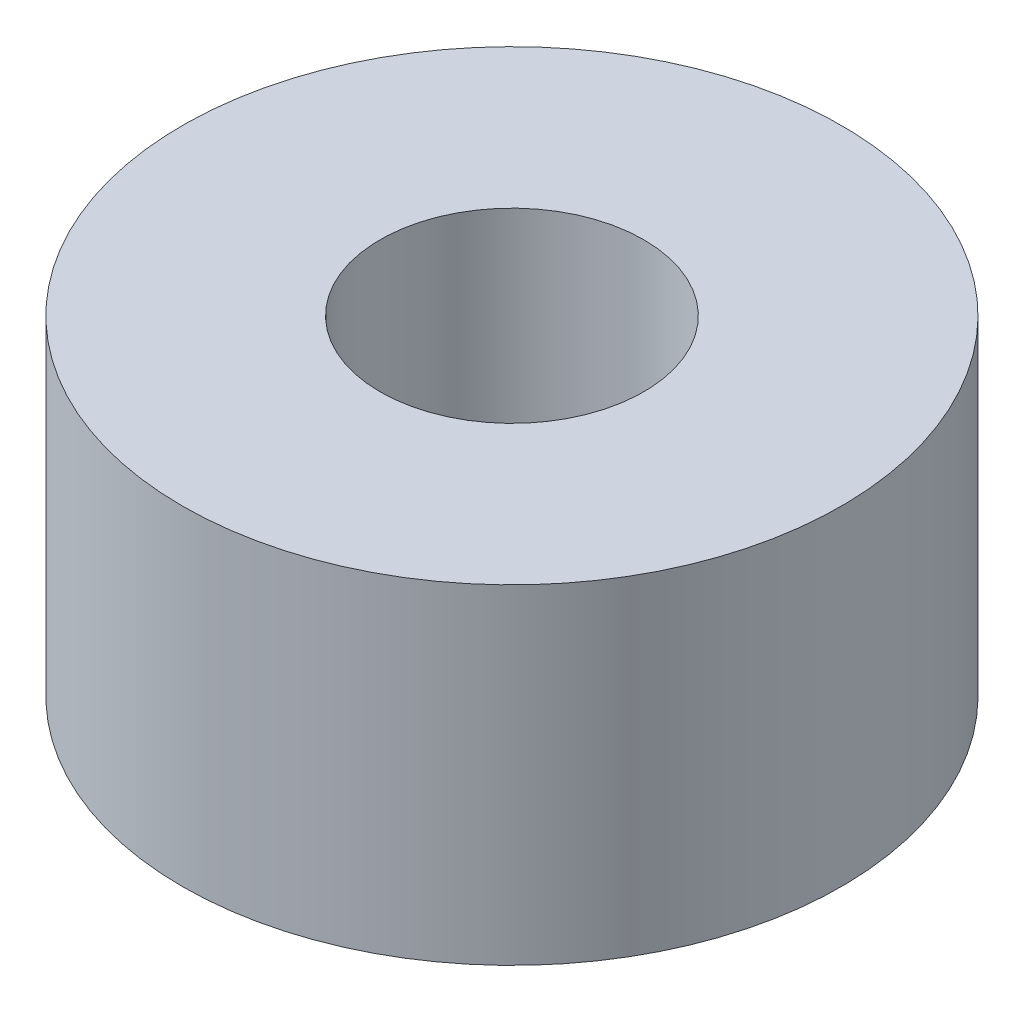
ISO-10303-21;
HEADER;
FILE_DESCRIPTION(('STEP AP214'),'2;1');
FILE_NAME('part.step','',(''),(''),'','','');
FILE_SCHEMA(('AUTOMOTIVE_DESIGN { 1 0 10303 214 1 1 1 1 }'));
ENDSEC;
DATA;
#1=APPLICATION_CONTEXT('core data for automotive mechanical design processes');
#2=APPLICATION_PROTOCOL_DEFINITION('international standard','automotive_design',2000,#1);
#3=PRODUCT_CONTEXT('',#1,'mechanical');
#4=PRODUCT('Part','Part','',(#3));
#5=PRODUCT_RELATED_PRODUCT_CATEGORY('part','',(#4));
#6=PRODUCT_DEFINITION_FORMATION('','',#4);
#7=PRODUCT_DEFINITION_CONTEXT('part definition',#1,'design');
#8=PRODUCT_DEFINITION('design','',#6,#7);
#9=PRODUCT_DEFINITION_SHAPE('','',#8);
#10=(LENGTH_UNIT() NAMED_UNIT(*) SI_UNIT(.MILLI.,.METRE.));
#11=(NAMED_UNIT(*) PLANE_ANGLE_UNIT() SI_UNIT($,.RADIAN.));
#12=(NAMED_UNIT(*) SI_UNIT($,.STERADIAN.) SOLID_ANGLE_UNIT());
#13=UNCERTAINTY_MEASURE_WITH_UNIT(LENGTH_MEASURE(1.E-05),#10,'distance_accuracy_value','');
#14=(GEOMETRIC_REPRESENTATION_CONTEXT(3) GLOBAL_UNCERTAINTY_ASSIGNED_CONTEXT((#13)) GLOBAL_UNIT_ASSIGNED_CONTEXT((#10,
#11,#12)) REPRESENTATION_CONTEXT('',''));
#15=CARTESIAN_POINT('',(0.,0.,0.));
#16=DIRECTION('',(0.,0.,1.));
#17=DIRECTION('',(1.,0.,0.));
#18=AXIS2_PLACEMENT_3D('',#15,#16,#17);
#19=CARTESIAN_POINT('',(0.,20.,0.));
#20=DIRECTION('',(0.,-1.,0.));
#21=DIRECTION('',(0.,0.,-1.));
#22=AXIS2_PLACEMENT_3D('',#19,#20,#21);
#23=CYLINDRICAL_SURFACE('',#22,20.);
#24=CARTESIAN_POINT('',(0.,20.,0.));
#25=DIRECTION('',(0.,1.,0.));
#26=DIRECTION('',(0.,0.,1.));
#27=AXIS2_PLACEMENT_3D('',#24,#25,#26);
#28=CIRCLE('',#27,20.);
#29=CARTESIAN_POINT('',(0.,20.,20.));
#30=VERTEX_POINT('',#29);
#31=EDGE_CURVE('E10',#30,#30,#28,.T.);
#32=ORIENTED_EDGE('',*,*,#31,.F.);
#33=EDGE_LOOP('',(#32));
#34=FACE_BOUND('',#33,.T.);
#35=CARTESIAN_POINT('',(0.,0.,0.));
#36=DIRECTION('',(0.,1.,0.));
#37=DIRECTION('',(0.,0.,1.));
#38=AXIS2_PLACEMENT_3D('',#35,#36,#37);
#39=CIRCLE('',#38,20.);
#40=CARTESIAN_POINT('',(0.,0.,20.));
#41=VERTEX_POINT('',#40);
#42=EDGE_CURVE('E34',#41,#41,#39,.T.);
#43=ORIENTED_EDGE('',*,*,#42,.T.);
#44=EDGE_LOOP('',(#43));
#45=FACE_BOUND('',#44,.T.);
#46=ADVANCED_FACE('F31',(#34,#45),#23,.T.);
#47=CARTESIAN_POINT('',(0.,20.,0.));
#48=DIRECTION('',(0.,1.,0.));
#49=DIRECTION('',(0.,0.,1.));
#50=AXIS2_PLACEMENT_3D('',#47,#48,#49);
#51=PLANE('',#50);
#52=CARTESIAN_POINT('',(0.,20.,0.));
#53=DIRECTION('',(0.,1.,0.));
#54=DIRECTION('',(0.,0.,1.));
#55=AXIS2_PLACEMENT_3D('',#52,#53,#54);
#56=CIRCLE('',#55,8.);
#57=CARTESIAN_POINT('',(0.,20.,8.));
#58=VERTEX_POINT('',#57);
#59=EDGE_CURVE('E43',#58,#58,#56,.T.);
#60=ORIENTED_EDGE('',*,*,#59,.F.);
#61=EDGE_LOOP('',(#60));
#62=FACE_BOUND('',#61,.T.);
#63=ORIENTED_EDGE('',*,*,#31,.T.);
#64=EDGE_LOOP('',(#63));
#65=FACE_BOUND('',#64,.T.);
#66=ADVANCED_FACE('F58',(#62,#65),#51,.T.);
#67=CARTESIAN_POINT('',(0.,0.,0.));
#68=DIRECTION('',(0.,1.,0.));
#69=DIRECTION('',(0.,0.,1.));
#70=AXIS2_PLACEMENT_3D('',#67,#68,#69);
#71=PLANE('',#70);
#72=CARTESIAN_POINT('',(0.,0.,0.));
#73=DIRECTION('',(0.,1.,0.));
#74=DIRECTION('',(0.,0.,1.));
#75=AXIS2_PLACEMENT_3D('',#72,#73,#74);
#76=CIRCLE('',#75,8.);
#77=CARTESIAN_POINT('',(0.,0.,8.));
#78=VERTEX_POINT('',#77);
#79=EDGE_CURVE('E41',#78,#78,#76,.T.);
#80=ORIENTED_EDGE('',*,*,#79,.T.);
#81=EDGE_LOOP('',(#80));
#82=FACE_BOUND('',#81,.T.);
#83=ORIENTED_EDGE('',*,*,#42,.F.);
#84=EDGE_LOOP('',(#83));
#85=FACE_BOUND('',#84,.T.);
#86=ADVANCED_FACE('F49',(#82,#85),#71,.F.);
#87=CARTESIAN_POINT('',(0.,0.,0.));
#88=DIRECTION('',(0.,1.,0.));
#89=DIRECTION('',(0.,0.,1.));
#90=AXIS2_PLACEMENT_3D('',#87,#88,#89);
#91=CYLINDRICAL_SURFACE('',#90,8.);
#92=ORIENTED_EDGE('',*,*,#79,.F.);
#93=EDGE_LOOP('',(#92));
#94=FACE_BOUND('',#93,.T.);
#95=ORIENTED_EDGE('',*,*,#59,.T.);
#96=EDGE_LOOP('',(#95));
#97=FACE_BOUND('',#96,.T.);
#98=ADVANCED_FACE('F52',(#94,#97),#91,.F.);
#99=CLOSED_SHELL('',(#46,#66,#86,#98));
#100=MANIFOLD_SOLID_BREP('B2',#99);
#101=ADVANCED_BREP_SHAPE_REPRESENTATION('',(#18,#100),#14);
#102=SHAPE_DEFINITION_REPRESENTATION(#9,#101);
ENDSEC;
END-ISO-10303-21;
